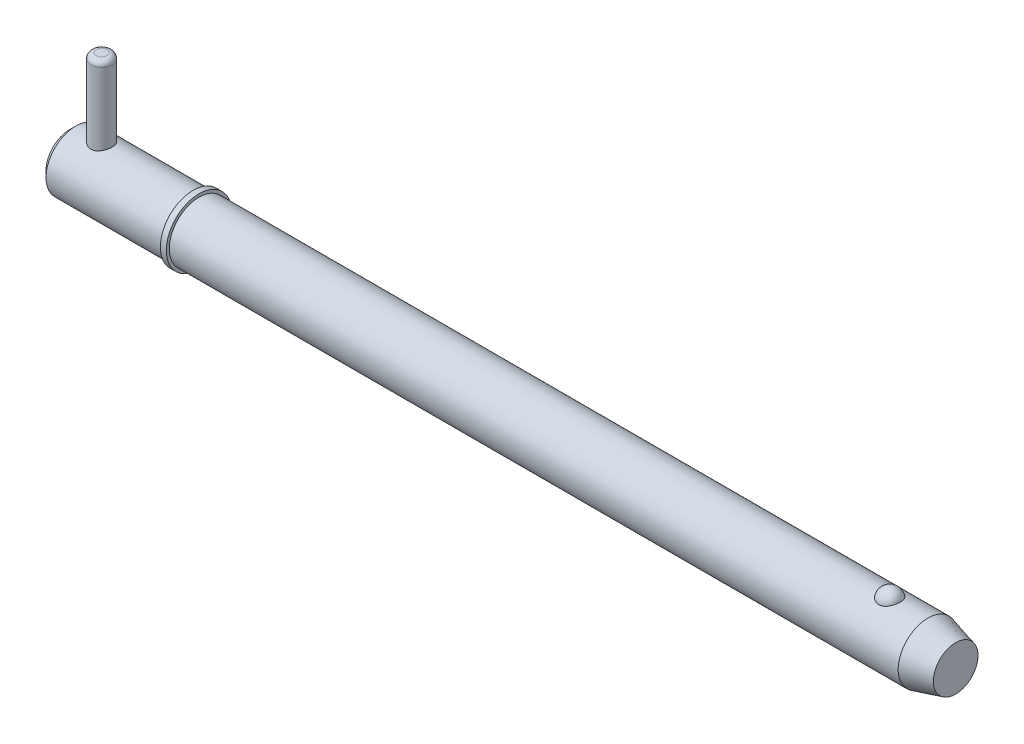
ISO-10303-21;
HEADER;
FILE_DESCRIPTION(('STEP AP214'),'2;1');
FILE_NAME('part.step','',(''),(''),'','','');
FILE_SCHEMA(('AUTOMOTIVE_DESIGN { 1 0 10303 214 1 1 1 1 }'));
ENDSEC;
DATA;
#1=APPLICATION_CONTEXT('core data for automotive mechanical design processes');
#2=APPLICATION_PROTOCOL_DEFINITION('international standard','automotive_design',2000,#1);
#3=PRODUCT_CONTEXT('',#1,'mechanical');
#4=PRODUCT('Part','Part','',(#3));
#5=PRODUCT_RELATED_PRODUCT_CATEGORY('part','',(#4));
#6=PRODUCT_DEFINITION_FORMATION('','',#4);
#7=PRODUCT_DEFINITION_CONTEXT('part definition',#1,'design');
#8=PRODUCT_DEFINITION('design','',#6,#7);
#9=PRODUCT_DEFINITION_SHAPE('','',#8);
#10=(LENGTH_UNIT() NAMED_UNIT(*) SI_UNIT(.MILLI.,.METRE.));
#11=(NAMED_UNIT(*) PLANE_ANGLE_UNIT() SI_UNIT($,.RADIAN.));
#12=(NAMED_UNIT(*) SI_UNIT($,.STERADIAN.) SOLID_ANGLE_UNIT());
#13=UNCERTAINTY_MEASURE_WITH_UNIT(LENGTH_MEASURE(1.E-05),#10,'distance_accuracy_value','');
#14=(GEOMETRIC_REPRESENTATION_CONTEXT(3) GLOBAL_UNCERTAINTY_ASSIGNED_CONTEXT((#13)) GLOBAL_UNIT_ASSIGNED_CONTEXT((#10,
#11,#12)) REPRESENTATION_CONTEXT('',''));
#15=CARTESIAN_POINT('',(0.,0.,0.));
#16=DIRECTION('',(0.,0.,1.));
#17=DIRECTION('',(1.,0.,0.));
#18=AXIS2_PLACEMENT_3D('',#15,#16,#17);
#19=CARTESIAN_POINT('',(5.94,19.845,0.));
#20=DIRECTION('',(0.,-1.,0.));
#21=DIRECTION('',(0.,0.,-1.));
#22=AXIS2_PLACEMENT_3D('',#19,#20,#21);
#23=CYLINDRICAL_SURFACE('',#22,1.98);
#24=CARTESIAN_POINT('',(5.94,-4.565,0.));
#25=DIRECTION('',(0.,1.,0.));
#26=DIRECTION('',(0.,0.,1.));
#27=AXIS2_PLACEMENT_3D('',#24,#25,#26);
#28=CIRCLE('',#27,1.98);
#29=CARTESIAN_POINT('',(5.94,-4.565,1.98));
#30=VERTEX_POINT('',#29);
#31=EDGE_CURVE('P0_E25',#30,#30,#28,.T.);
#32=ORIENTED_EDGE('',*,*,#31,.T.);
#33=EDGE_LOOP('',(#32));
#34=FACE_BOUND('',#33,.T.);
#35=CARTESIAN_POINT('',(5.94,18.855,0.));
#36=DIRECTION('',(0.,1.,0.));
#37=DIRECTION('',(0.,0.,1.));
#38=AXIS2_PLACEMENT_3D('',#35,#36,#37);
#39=CIRCLE('',#38,1.98);
#40=CARTESIAN_POINT('',(5.94,18.855,1.98));
#41=VERTEX_POINT('',#40);
#42=EDGE_CURVE('P0_E29',#41,#41,#39,.F.);
#43=ORIENTED_EDGE('',*,*,#42,.T.);
#44=EDGE_LOOP('',(#43));
#45=FACE_BOUND('',#44,.T.);
#46=ADVANCED_FACE('P0_F14',(#34,#45),#23,.T.);
#47=CARTESIAN_POINT('',(5.94,19.845,0.));
#48=DIRECTION('',(0.,1.,0.));
#49=DIRECTION('',(0.,0.,1.));
#50=AXIS2_PLACEMENT_3D('',#47,#48,#49);
#51=PLANE('',#50);
#52=CARTESIAN_POINT('',(5.94,19.845,0.));
#53=DIRECTION('',(0.,1.,0.));
#54=DIRECTION('',(0.,0.,1.));
#55=AXIS2_PLACEMENT_3D('',#52,#53,#54);
#56=CIRCLE('',#55,0.99);
#57=CARTESIAN_POINT('',(5.94,19.845,0.99));
#58=VERTEX_POINT('',#57);
#59=EDGE_CURVE('P0_E10',#58,#58,#56,.T.);
#60=ORIENTED_EDGE('',*,*,#59,.T.);
#61=EDGE_LOOP('',(#60));
#62=FACE_BOUND('',#61,.T.);
#63=ADVANCED_FACE('P0_F46',(#62),#51,.T.);
#64=CARTESIAN_POINT('',(5.94,-5.555,0.));
#65=DIRECTION('',(0.,1.,0.));
#66=DIRECTION('',(0.,0.,1.));
#67=AXIS2_PLACEMENT_3D('',#64,#65,#66);
#68=PLANE('',#67);
#69=CARTESIAN_POINT('',(5.94,-5.555,0.));
#70=DIRECTION('',(0.,1.,0.));
#71=DIRECTION('',(0.,0.,1.));
#72=AXIS2_PLACEMENT_3D('',#69,#70,#71);
#73=CIRCLE('',#72,0.99);
#74=CARTESIAN_POINT('',(5.94,-5.555,0.99));
#75=VERTEX_POINT('',#74);
#76=EDGE_CURVE('P0_E21',#75,#75,#73,.F.);
#77=ORIENTED_EDGE('',*,*,#76,.T.);
#78=EDGE_LOOP('',(#77));
#79=FACE_BOUND('',#78,.T.);
#80=ADVANCED_FACE('P0_F43',(#79),#68,.F.);
#81=CARTESIAN_POINT('',(5.94,-4.565,0.));
#82=DIRECTION('',(0.,1.,0.));
#83=DIRECTION('',(0.,0.,1.));
#84=AXIS2_PLACEMENT_3D('',#81,#82,#83);
#85=DEGENERATE_TOROIDAL_SURFACE('',#84,0.99,0.99,.T.);
#86=ORIENTED_EDGE('',*,*,#76,.F.);
#87=EDGE_LOOP('',(#86));
#88=FACE_BOUND('',#87,.T.);
#89=ORIENTED_EDGE('',*,*,#31,.F.);
#90=EDGE_LOOP('',(#89));
#91=FACE_BOUND('',#90,.T.);
#92=ADVANCED_FACE('P0_F38',(#88,#91),#85,.T.);
#93=CARTESIAN_POINT('',(5.94,18.855,0.));
#94=DIRECTION('',(0.,1.,0.));
#95=DIRECTION('',(0.,0.,1.));
#96=AXIS2_PLACEMENT_3D('',#93,#94,#95);
#97=DEGENERATE_TOROIDAL_SURFACE('',#96,0.99,0.99,.T.);
#98=ORIENTED_EDGE('',*,*,#42,.F.);
#99=EDGE_LOOP('',(#98));
#100=FACE_BOUND('',#99,.T.);
#101=ORIENTED_EDGE('',*,*,#59,.F.);
#102=EDGE_LOOP('',(#101));
#103=FACE_BOUND('',#102,.T.);
#104=ADVANCED_FACE('P0_F16',(#100,#103),#97,.T.);
#105=CLOSED_SHELL('',(#46,#63,#80,#92,#104));
#106=MANIFOLD_SOLID_BREP('P0_B1',#105);
#107=CARTESIAN_POINT('',(0.,0.,0.));
#108=DIRECTION('',(1.,0.,0.));
#109=DIRECTION('',(0.,0.,-1.));
#110=AXIS2_PLACEMENT_3D('',#107,#108,#109);
#111=CYLINDRICAL_SURFACE('',#110,5.555);
#112=CARTESIAN_POINT('',(160.217114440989,0.,0.));
#113=DIRECTION('',(1.,0.,0.));
#114=DIRECTION('',(0.,0.,-1.));
#115=AXIS2_PLACEMENT_3D('',#112,#113,#114);
#116=CIRCLE('',#115,5.555);
#117=CARTESIAN_POINT('',(160.217114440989,0.,-5.555));
#118=VERTEX_POINT('',#117);
#119=EDGE_CURVE('P1_E81',#118,#118,#116,.T.);
#120=ORIENTED_EDGE('',*,*,#119,.F.);
#121=EDGE_LOOP('',(#120));
#122=FACE_BOUND('',#121,.T.);
#123=CARTESIAN_POINT('',(24.13,0.,0.));
#124=DIRECTION('',(1.,0.,0.));
#125=DIRECTION('',(0.,0.,-1.));
#126=AXIS2_PLACEMENT_3D('',#123,#124,#125);
#127=CIRCLE('',#126,5.555);
#128=CARTESIAN_POINT('',(24.13,0.,-5.555));
#129=VERTEX_POINT('',#128);
#130=EDGE_CURVE('P1_E85',#129,#129,#127,.T.);
#131=ORIENTED_EDGE('',*,*,#130,.T.);
#132=EDGE_LOOP('',(#131));
#133=FACE_BOUND('',#132,.T.);
#134=CARTESIAN_POINT('',(153.098626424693,5.16741224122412,2.03859650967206));
#135=CARTESIAN_POINT('',(152.992949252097,5.16740893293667,2.03859990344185));
#136=CARTESIAN_POINT('',(152.88729894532,5.17079470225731,2.03008306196));
#137=CARTESIAN_POINT('',(152.679141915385,5.18392795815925,1.99630721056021));
#138=CARTESIAN_POINT('',(152.576634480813,5.19367399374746,1.97105201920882));
#139=CARTESIAN_POINT('',(152.377771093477,5.21839168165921,1.9046399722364));
#140=CARTESIAN_POINT('',(152.281406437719,5.23335573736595,1.8635062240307));
#141=CARTESIAN_POINT('',(152.097080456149,5.26688076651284,1.76652592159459));
#142=CARTESIAN_POINT('',(152.009120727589,5.28544242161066,1.71067657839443));
#143=CARTESIAN_POINT('',(151.841265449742,5.32479845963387,1.58399959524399));
#144=CARTESIAN_POINT('',(151.76166564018,5.34564089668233,1.51279545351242));
#145=CARTESIAN_POINT('',(151.61512901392,5.38697258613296,1.35828584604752));
#146=CARTESIAN_POINT('',(151.548194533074,5.40746177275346,1.27497815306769));
#147=CARTESIAN_POINT('',(151.42561039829,5.44694508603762,1.0944029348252));
#148=CARTESIAN_POINT('',(151.370598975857,5.46583143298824,0.996677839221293));
#149=CARTESIAN_POINT('',(151.276937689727,5.49908030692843,0.792961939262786));
#150=CARTESIAN_POINT('',(151.238289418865,5.513442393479,0.686970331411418));
#151=CARTESIAN_POINT('',(151.177680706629,5.53635851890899,0.468019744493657));
#152=CARTESIAN_POINT('',(151.155972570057,5.54482455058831,0.354981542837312));
#153=CARTESIAN_POINT('',(151.130636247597,5.55473324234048,0.12659586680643));
#154=CARTESIAN_POINT('',(151.127007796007,5.55617600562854,0.0112484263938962));
#155=CARTESIAN_POINT('',(151.137881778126,5.55189984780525,-0.218011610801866));
#156=CARTESIAN_POINT('',(151.152315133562,5.54620821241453,-0.331928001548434));
#157=CARTESIAN_POINT('',(151.198903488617,5.52828920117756,-0.555544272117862));
#158=CARTESIAN_POINT('',(151.231058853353,5.5160616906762,-0.665244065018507));
#159=CARTESIAN_POINT('',(151.312488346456,5.48630779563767,-0.877469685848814));
#160=CARTESIAN_POINT('',(151.361781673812,5.4687754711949,-0.979987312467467));
#161=CARTESIAN_POINT('',(151.476478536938,5.43024700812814,-1.17486975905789));
#162=CARTESIAN_POINT('',(151.541883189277,5.4092506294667,-1.26723387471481));
#163=CARTESIAN_POINT('',(151.687571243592,5.36600927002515,-1.4394013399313));
#164=CARTESIAN_POINT('',(151.767885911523,5.34376173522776,-1.51917763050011));
#165=CARTESIAN_POINT('',(151.941452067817,5.30057971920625,-1.66360338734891));
#166=CARTESIAN_POINT('',(152.034702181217,5.27964509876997,-1.72825445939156));
#167=CARTESIAN_POINT('',(152.229393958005,5.24205250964,-1.83909478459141));
#168=CARTESIAN_POINT('',(152.330590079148,5.22530519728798,-1.88568407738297));
#169=CARTESIAN_POINT('',(152.540155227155,5.1975091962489,-1.96100802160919));
#170=CARTESIAN_POINT('',(152.648521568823,5.1864583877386,-1.98974931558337));
#171=CARTESIAN_POINT('',(152.863498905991,5.17184410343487,-2.02742262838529));
#172=CARTESIAN_POINT('',(152.969925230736,5.1679328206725,-2.03727608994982));
#173=CARTESIAN_POINT('',(153.182992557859,5.16698995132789,-2.03966777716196));
#174=CARTESIAN_POINT('',(153.289633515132,5.16995704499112,-2.0322093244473));
#175=CARTESIAN_POINT('',(153.496773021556,5.18222383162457,-2.00071170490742));
#176=CARTESIAN_POINT('',(153.597359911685,5.19133213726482,-1.97717337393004));
#177=CARTESIAN_POINT('',(153.793014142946,5.21467637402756,-1.91475248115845));
#178=CARTESIAN_POINT('',(153.888081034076,5.22891272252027,-1.87586867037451));
#179=CARTESIAN_POINT('',(154.072371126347,5.26137066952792,-1.78282713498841));
#180=CARTESIAN_POINT('',(154.161419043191,5.27967329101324,-1.72835124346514));
#181=CARTESIAN_POINT('',(154.329288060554,5.3181741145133,-1.60597483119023));
#182=CARTESIAN_POINT('',(154.408106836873,5.33837274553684,-1.5380712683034));
#183=CARTESIAN_POINT('',(154.557515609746,5.37968287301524,-1.38688970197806));
#184=CARTESIAN_POINT('',(154.627505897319,5.40079011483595,-1.30301744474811));
#185=CARTESIAN_POINT('',(154.753012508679,5.44074401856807,-1.12458170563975));
#186=CARTESIAN_POINT('',(154.808526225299,5.45959027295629,-1.03001630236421));
#187=CARTESIAN_POINT('',(154.905550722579,5.49369849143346,-0.829439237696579));
#188=CARTESIAN_POINT('',(154.946548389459,5.50882422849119,-0.723155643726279));
#189=CARTESIAN_POINT('',(155.011125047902,5.53310911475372,-0.504772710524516));
#190=CARTESIAN_POINT('',(155.034703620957,5.54226812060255,-0.392673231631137));
#191=CARTESIAN_POINT('',(155.064013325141,5.55370358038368,-0.165459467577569));
#192=CARTESIAN_POINT('',(155.069688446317,5.55595843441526,-0.0503368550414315));
#193=CARTESIAN_POINT('',(155.062916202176,5.55329317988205,0.179288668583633));
#194=CARTESIAN_POINT('',(155.050469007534,5.54837313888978,0.293791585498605));
#195=CARTESIAN_POINT('',(155.007779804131,5.53189037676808,0.51852641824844));
#196=CARTESIAN_POINT('',(154.977598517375,5.5203503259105,0.62877154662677));
#197=CARTESIAN_POINT('',(154.900096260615,5.49182453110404,0.842318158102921));
#198=CARTESIAN_POINT('',(154.852774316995,5.47483847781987,0.945619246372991));
#199=CARTESIAN_POINT('',(154.741720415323,5.43710633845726,1.14281571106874));
#200=CARTESIAN_POINT('',(154.677921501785,5.41634501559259,1.23667048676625));
#201=CARTESIAN_POINT('',(154.535357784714,5.37334572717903,1.4118524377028));
#202=CARTESIAN_POINT('',(154.45659323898,5.35110778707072,1.49317982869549));
#203=CARTESIAN_POINT('',(154.286423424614,5.30779474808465,1.64049162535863));
#204=CARTESIAN_POINT('',(154.19510026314,5.28671324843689,1.70656877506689));
#205=CARTESIAN_POINT('',(154.001739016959,5.2480485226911,1.82201372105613));
#206=CARTESIAN_POINT('',(153.899700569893,5.23046541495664,1.87138095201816));
#207=CARTESIAN_POINT('',(153.683618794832,5.20042692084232,1.95335298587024));
#208=CARTESIAN_POINT('',(153.569260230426,5.18820192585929,1.98521734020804));
#209=CARTESIAN_POINT('',(153.336130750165,5.17169804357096,2.02783294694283));
#210=CARTESIAN_POINT('',(153.217361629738,5.16741595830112,2.03859269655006));
#211=CARTESIAN_POINT('',(153.098626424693,5.16741224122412,2.03859650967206));
#212=B_SPLINE_CURVE_WITH_KNOTS('',3,(#134,#135,#136,#137,#138,#139,#140,#141,#142,#143,#144,
#145,#146,#147,#148,#149,#150,#151,#152,#153,#154,#155,#156,#157,#158,#159,#160,#161,#162,#163,
#164,#165,#166,#167,#168,#169,#170,#171,#172,#173,#174,#175,#176,#177,#178,#179,#180,#181,#182,
#183,#184,#185,#186,#187,#188,#189,#190,#191,#192,#193,#194,#195,#196,#197,#198,#199,#200,#201,
#202,#203,#204,#205,#206,#207,#208,#209,#210,#211),.UNSPECIFIED.,.T.,.F.,(4,2,2,2,2,2,2,2,2,2,2,
2,2,2,2,2,2,2,2,2,2,2,2,2,2,2,2,2,2,2,2,2,2,2,2,2,2,2,4),(0.,0.316595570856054,
0.633118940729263,0.94918341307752,1.26530783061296,1.59030762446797,1.91536729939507,
2.25495824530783,2.59458224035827,2.93917283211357,3.28375835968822,3.62703002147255,
3.97030875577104,4.31397329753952,4.657661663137,5.00207904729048,5.34645984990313,
5.68270547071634,6.01882587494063,6.33808403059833,6.65728093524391,6.9669637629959,
7.27667180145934,7.59321535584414,7.90983070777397,8.24210387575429,8.57443684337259,
8.91755896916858,9.26068933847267,9.60489211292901,9.94909164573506,10.2921194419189,
10.6351667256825,10.9796305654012,11.3240884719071,11.6663928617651,12.0087088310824,
12.3645679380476,12.7202837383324),.UNSPECIFIED.);
#213=CARTESIAN_POINT('',(153.098626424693,5.16741224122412,2.03859650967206));
#214=VERTEX_POINT('',#213);
#215=EDGE_CURVE('P1_E35',#214,#214,#212,.T.);
#216=ORIENTED_EDGE('',*,*,#215,.T.);
#217=EDGE_LOOP('',(#216));
#218=FACE_BOUND('',#217,.T.);
#219=ADVANCED_FACE('P1_F13',(#122,#133,#218),#111,.T.);
#220=CARTESIAN_POINT('',(0.,0.,0.));
#221=DIRECTION('',(-1.,0.,0.));
#222=DIRECTION('',(0.,0.,1.));
#223=AXIS2_PLACEMENT_3D('',#220,#221,#222);
#224=PLANE('',#223);
#225=CARTESIAN_POINT('',(0.,0.,0.));
#226=DIRECTION('',(1.,0.,0.));
#227=DIRECTION('',(0.,0.,-1.));
#228=AXIS2_PLACEMENT_3D('',#225,#226,#227);
#229=CIRCLE('',#228,4.444);
#230=CARTESIAN_POINT('',(0.,0.,-4.444));
#231=VERTEX_POINT('',#230);
#232=EDGE_CURVE('P1_E9',#231,#231,#229,.T.);
#233=ORIENTED_EDGE('',*,*,#232,.F.);
#234=EDGE_LOOP('',(#233));
#235=FACE_BOUND('',#234,.T.);
#236=ADVANCED_FACE('P1_F15',(#235),#224,.T.);
#237=CARTESIAN_POINT('',(1.111,0.,0.));
#238=DIRECTION('',(1.,0.,0.));
#239=DIRECTION('',(0.,0.,-1.));
#240=AXIS2_PLACEMENT_3D('',#237,#238,#239);
#241=CONICAL_SURFACE('',#240,5.555,0.78539816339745);
#242=ORIENTED_EDGE('',*,*,#232,.T.);
#243=EDGE_LOOP('',(#242));
#244=FACE_BOUND('',#243,.T.);
#245=CARTESIAN_POINT('',(1.111,0.,0.));
#246=DIRECTION('',(1.,0.,0.));
#247=DIRECTION('',(0.,0.,-1.));
#248=AXIS2_PLACEMENT_3D('',#245,#246,#247);
#249=CIRCLE('',#248,5.555);
#250=CARTESIAN_POINT('',(1.111,0.,-5.555));
#251=VERTEX_POINT('',#250);
#252=EDGE_CURVE('P1_E26',#251,#251,#249,.T.);
#253=ORIENTED_EDGE('',*,*,#252,.F.);
#254=EDGE_LOOP('',(#253));
#255=FACE_BOUND('',#254,.T.);
#256=ADVANCED_FACE('P1_F77',(#244,#255),#241,.T.);
#257=CARTESIAN_POINT('',(0.,0.,0.));
#258=DIRECTION('',(1.,0.,0.));
#259=DIRECTION('',(0.,0.,-1.));
#260=AXIS2_PLACEMENT_3D('',#257,#258,#259);
#261=CYLINDRICAL_SURFACE('',#260,5.555);
#262=CARTESIAN_POINT('',(5.94,-5.19014691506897,1.98));
#263=CARTESIAN_POINT('',(5.83264687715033,-5.19014494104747,1.98000226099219));
#264=CARTESIAN_POINT('',(5.7253094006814,-5.19351395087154,1.97123988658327));
#265=CARTESIAN_POINT('',(5.51384517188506,-5.20654291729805,1.93656219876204));
#266=CARTESIAN_POINT('',(5.40971858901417,-5.21620320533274,1.91064598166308));
#267=CARTESIAN_POINT('',(5.20778082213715,-5.24058443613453,1.84271148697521));
#268=CARTESIAN_POINT('',(5.10995634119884,-5.25529427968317,1.80072850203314));
#269=CARTESIAN_POINT('',(4.92270352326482,-5.28810012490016,1.70197537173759));
#270=CARTESIAN_POINT('',(4.83327743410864,-5.3061970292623,1.64520128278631));
#271=CARTESIAN_POINT('',(4.66135184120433,-5.34464714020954,1.51575187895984));
#272=CARTESIAN_POINT('',(4.57928277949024,-5.36506222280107,1.44252311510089));
#273=CARTESIAN_POINT('',(4.42829115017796,-5.40532920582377,1.28342047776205));
#274=CARTESIAN_POINT('',(4.35937105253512,-5.42518099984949,1.19754423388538));
#275=CARTESIAN_POINT('',(4.23461605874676,-5.46281133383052,1.01237205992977));
#276=CARTESIAN_POINT('',(4.17924129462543,-5.48050875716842,0.912748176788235));
#277=CARTESIAN_POINT('',(4.0862117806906,-5.51109938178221,0.70485824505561));
#278=CARTESIAN_POINT('',(4.0485515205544,-5.52399407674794,0.596594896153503));
#279=CARTESIAN_POINT('',(3.99350662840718,-5.54308759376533,0.379019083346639));
#280=CARTESIAN_POINT('',(3.97538263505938,-5.54952987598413,0.269915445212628));
#281=CARTESIAN_POINT('',(3.95756405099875,-5.55586205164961,0.0500378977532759));
#282=CARTESIAN_POINT('',(3.95786404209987,-5.55575387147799,-0.060735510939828));
#283=CARTESIAN_POINT('',(3.97643665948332,-5.54915684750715,-0.275539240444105));
#284=CARTESIAN_POINT('',(3.99390415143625,-5.54295384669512,-0.379649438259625));
#285=CARTESIAN_POINT('',(4.0449721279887,-5.52523170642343,-0.583350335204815));
#286=CARTESIAN_POINT('',(4.07857373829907,-5.51371219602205,-0.682940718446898));
#287=CARTESIAN_POINT('',(4.16137312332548,-5.4863099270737,-0.876423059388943));
#288=CARTESIAN_POINT('',(4.2107826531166,-5.47036834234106,-0.970215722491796));
#289=CARTESIAN_POINT('',(4.32361427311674,-5.43575653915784,-1.1484017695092));
#290=CARTESIAN_POINT('',(4.38704062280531,-5.41708549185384,-1.23279228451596));
#291=CARTESIAN_POINT('',(4.53006791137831,-5.37778429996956,-1.39454579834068));
#292=CARTESIAN_POINT('',(4.61035105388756,-5.35710277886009,-1.4712940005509));
#293=CARTESIAN_POINT('',(4.78279835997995,-5.31692766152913,-1.6104545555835));
#294=CARTESIAN_POINT('',(4.874964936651,-5.29743430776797,-1.67286398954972));
#295=CARTESIAN_POINT('',(5.07076688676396,-5.26153775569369,-1.78259698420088));
#296=CARTESIAN_POINT('',(5.17458163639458,-5.24519780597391,-1.8296227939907));
#297=CARTESIAN_POINT('',(5.38938990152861,-5.21818744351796,-1.90530278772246));
#298=CARTESIAN_POINT('',(5.50037985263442,-5.20751423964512,-1.93396601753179));
#299=CARTESIAN_POINT('',(5.72036376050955,-5.19369176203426,-1.97077654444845));
#300=CARTESIAN_POINT('',(5.82917370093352,-5.19018851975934,-1.97989015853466));
#301=CARTESIAN_POINT('',(6.04680100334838,-5.19010609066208,-1.98010779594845));
#302=CARTESIAN_POINT('',(6.15561835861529,-5.19352540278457,-1.97121572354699));
#303=CARTESIAN_POINT('',(6.36548036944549,-5.20654623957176,-1.93654727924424));
#304=CARTESIAN_POINT('',(6.46666051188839,-5.21588705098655,-1.91148218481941));
#305=CARTESIAN_POINT('',(6.66334537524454,-5.23939939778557,-1.84605494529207));
#306=CARTESIAN_POINT('',(6.75884899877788,-5.25357186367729,-1.8056898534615));
#307=CARTESIAN_POINT('',(6.94517989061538,-5.28576258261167,-1.70921153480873));
#308=CARTESIAN_POINT('',(7.03572661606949,-5.30389804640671,-1.65259670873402));
#309=CARTESIAN_POINT('',(7.20638087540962,-5.34176077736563,-1.52577523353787));
#310=CARTESIAN_POINT('',(7.28648490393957,-5.36148857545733,-1.45556404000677));
#311=CARTESIAN_POINT('',(7.43864697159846,-5.40165494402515,-1.2988614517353));
#312=CARTESIAN_POINT('',(7.50999887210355,-5.42207106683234,-1.21167640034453));
#313=CARTESIAN_POINT('',(7.63712639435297,-5.46023601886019,-1.026066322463));
#314=CARTESIAN_POINT('',(7.69290228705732,-5.47798489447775,-0.927641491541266));
#315=CARTESIAN_POINT('',(7.78684673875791,-5.50876590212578,-0.722633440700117));
#316=CARTESIAN_POINT('',(7.82510508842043,-5.52182201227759,-0.616095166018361));
#317=CARTESIAN_POINT('',(7.88297051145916,-5.54184206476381,-0.397530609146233));
#318=CARTESIAN_POINT('',(7.90258540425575,-5.5488085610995,-0.285506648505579));
#319=CARTESIAN_POINT('',(7.9218262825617,-5.55564472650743,-0.065566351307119));
#320=CARTESIAN_POINT('',(7.92245987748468,-5.55587212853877,0.0422515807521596));
#321=CARTESIAN_POINT('',(7.90626329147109,-5.55011340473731,0.256387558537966));
#322=CARTESIAN_POINT('',(7.88943488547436,-5.54412791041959,0.362705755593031));
#323=CARTESIAN_POINT('',(7.83948457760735,-5.52676548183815,0.568649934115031));
#324=CARTESIAN_POINT('',(7.8067003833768,-5.51550046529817,0.668367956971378));
#325=CARTESIAN_POINT('',(7.72609369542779,-5.48874437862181,0.860911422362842));
#326=CARTESIAN_POINT('',(7.67826838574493,-5.47325251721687,0.953735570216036));
#327=CARTESIAN_POINT('',(7.56675024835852,-5.43884382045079,1.13391068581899));
#328=CARTESIAN_POINT('',(7.50249968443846,-5.41981485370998,1.22089468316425));
#329=CARTESIAN_POINT('',(7.36086495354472,-5.38069275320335,1.38316665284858));
#330=CARTESIAN_POINT('',(7.28347630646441,-5.36059925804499,1.45845061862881));
#331=CARTESIAN_POINT('',(7.11347587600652,-5.32048380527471,1.59876646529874));
#332=CARTESIAN_POINT('',(7.02032386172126,-5.30050854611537,1.66315951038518));
#333=CARTESIAN_POINT('',(6.82388804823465,-5.26398994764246,1.77536801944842));
#334=CARTESIAN_POINT('',(6.7206049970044,-5.24744635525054,1.82318470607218));
#335=CARTESIAN_POINT('',(6.50639706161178,-5.21987969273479,1.90068230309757));
#336=CARTESIAN_POINT('',(6.3954529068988,-5.20887116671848,1.93031547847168));
#337=CARTESIAN_POINT('',(6.16966522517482,-5.19400760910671,1.96996824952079));
#338=CARTESIAN_POINT('',(6.05482366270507,-5.19014902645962,1.97999758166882));
#339=CARTESIAN_POINT('',(5.94,-5.19014691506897,1.98));
#340=B_SPLINE_CURVE_WITH_KNOTS('',3,(#262,#263,#264,#265,#266,#267,#268,#269,#270,#271,#272,
#273,#274,#275,#276,#277,#278,#279,#280,#281,#282,#283,#284,#285,#286,#287,#288,#289,#290,#291,
#292,#293,#294,#295,#296,#297,#298,#299,#300,#301,#302,#303,#304,#305,#306,#307,#308,#309,#310,
#311,#312,#313,#314,#315,#316,#317,#318,#319,#320,#321,#322,#323,#324,#325,#326,#327,#328,#329,
#330,#331,#332,#333,#334,#335,#336,#337,#338,#339),.UNSPECIFIED.,.T.,.F.,(4,2,2,2,2,2,2,2,2,2,2,
2,2,2,2,2,2,2,2,2,2,2,2,2,2,2,2,2,2,2,2,2,2,2,2,2,2,2,4),(0.,0.321632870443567,
0.643282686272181,0.964229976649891,1.28526292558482,1.61937087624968,1.9535415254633,
2.29784481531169,2.64204093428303,2.97269632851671,3.30325448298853,3.61901541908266,
3.93479838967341,4.25500220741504,4.57530346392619,4.91268648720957,5.25013812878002,
5.59378026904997,5.93725299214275,6.26331481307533,6.58930593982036,6.90185604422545,
7.21446637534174,7.53801472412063,7.86167140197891,8.20353561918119,8.54539388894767,
8.88547970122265,9.22542281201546,9.54728637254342,9.86911722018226,10.1844146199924,
10.4997710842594,10.827730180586,11.1558013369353,11.499115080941,11.8424034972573,
12.1865892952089,12.5306041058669),.UNSPECIFIED.);
#341=CARTESIAN_POINT('',(5.94,-5.19014691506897,1.98));
#342=VERTEX_POINT('',#341);
#343=EDGE_CURVE('P1_E17',#342,#342,#340,.T.);
#344=ORIENTED_EDGE('',*,*,#343,.F.);
#345=EDGE_LOOP('',(#344));
#346=FACE_BOUND('',#345,.T.);
#347=CARTESIAN_POINT('',(5.94,5.19014691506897,1.98));
#348=CARTESIAN_POINT('',(6.04735312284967,5.19014494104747,1.98000226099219));
#349=CARTESIAN_POINT('',(6.1546905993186,5.19351395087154,1.97123988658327));
#350=CARTESIAN_POINT('',(6.36615482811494,5.20654291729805,1.93656219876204));
#351=CARTESIAN_POINT('',(6.47028141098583,5.21620320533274,1.91064598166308));
#352=CARTESIAN_POINT('',(6.67221917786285,5.24058443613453,1.84271148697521));
#353=CARTESIAN_POINT('',(6.77004365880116,5.25529427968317,1.80072850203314));
#354=CARTESIAN_POINT('',(6.95729647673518,5.28810012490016,1.70197537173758));
#355=CARTESIAN_POINT('',(7.04672256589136,5.3061970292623,1.64520128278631));
#356=CARTESIAN_POINT('',(7.21864815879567,5.34464714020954,1.51575187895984));
#357=CARTESIAN_POINT('',(7.30071722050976,5.36506222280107,1.44252311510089));
#358=CARTESIAN_POINT('',(7.45170884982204,5.40532920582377,1.28342047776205));
#359=CARTESIAN_POINT('',(7.52062894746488,5.42518099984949,1.19754423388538));
#360=CARTESIAN_POINT('',(7.64538394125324,5.46281133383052,1.01237205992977));
#361=CARTESIAN_POINT('',(7.70075870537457,5.48050875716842,0.912748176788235));
#362=CARTESIAN_POINT('',(7.7937882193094,5.51109938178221,0.704858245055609));
#363=CARTESIAN_POINT('',(7.8314484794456,5.52399407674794,0.596594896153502));
#364=CARTESIAN_POINT('',(7.88649337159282,5.54308759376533,0.379019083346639));
#365=CARTESIAN_POINT('',(7.90461736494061,5.54952987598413,0.269915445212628));
#366=CARTESIAN_POINT('',(7.92243594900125,5.55586205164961,0.0500378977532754));
#367=CARTESIAN_POINT('',(7.92213595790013,5.55575387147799,-0.0607355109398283));
#368=CARTESIAN_POINT('',(7.90356334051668,5.54915684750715,-0.275539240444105));
#369=CARTESIAN_POINT('',(7.88609584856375,5.54295384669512,-0.379649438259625));
#370=CARTESIAN_POINT('',(7.8350278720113,5.52523170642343,-0.583350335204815));
#371=CARTESIAN_POINT('',(7.80142626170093,5.51371219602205,-0.682940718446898));
#372=CARTESIAN_POINT('',(7.71862687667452,5.4863099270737,-0.876423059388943));
#373=CARTESIAN_POINT('',(7.6692173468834,5.47036834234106,-0.970215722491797));
#374=CARTESIAN_POINT('',(7.55638572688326,5.43575653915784,-1.1484017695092));
#375=CARTESIAN_POINT('',(7.49295937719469,5.41708549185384,-1.23279228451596));
#376=CARTESIAN_POINT('',(7.34993208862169,5.37778429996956,-1.39454579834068));
#377=CARTESIAN_POINT('',(7.26964894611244,5.35710277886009,-1.4712940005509));
#378=CARTESIAN_POINT('',(7.09720164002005,5.31692766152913,-1.6104545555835));
#379=CARTESIAN_POINT('',(7.00503506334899,5.29743430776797,-1.67286398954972));
#380=CARTESIAN_POINT('',(6.80923311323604,5.26153775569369,-1.78259698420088));
#381=CARTESIAN_POINT('',(6.70541836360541,5.24519780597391,-1.8296227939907));
#382=CARTESIAN_POINT('',(6.49061009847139,5.21818744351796,-1.90530278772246));
#383=CARTESIAN_POINT('',(6.37962014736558,5.20751423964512,-1.93396601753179));
#384=CARTESIAN_POINT('',(6.15963623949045,5.19369176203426,-1.97077654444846));
#385=CARTESIAN_POINT('',(6.05082629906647,5.19018851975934,-1.97989015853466));
#386=CARTESIAN_POINT('',(5.83319899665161,5.19010609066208,-1.98010779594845));
#387=CARTESIAN_POINT('',(5.7243816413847,5.19352540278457,-1.97121572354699));
#388=CARTESIAN_POINT('',(5.5145196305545,5.20654623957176,-1.93654727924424));
#389=CARTESIAN_POINT('',(5.4133394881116,5.21588705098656,-1.91148218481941));
#390=CARTESIAN_POINT('',(5.21665462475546,5.23939939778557,-1.84605494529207));
#391=CARTESIAN_POINT('',(5.12115100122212,5.25357186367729,-1.8056898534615));
#392=CARTESIAN_POINT('',(4.93482010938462,5.28576258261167,-1.70921153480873));
#393=CARTESIAN_POINT('',(4.84427338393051,5.30389804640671,-1.65259670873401));
#394=CARTESIAN_POINT('',(4.67361912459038,5.34176077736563,-1.52577523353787));
#395=CARTESIAN_POINT('',(4.59351509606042,5.36148857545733,-1.45556404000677));
#396=CARTESIAN_POINT('',(4.44135302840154,5.40165494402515,-1.2988614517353));
#397=CARTESIAN_POINT('',(4.37000112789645,5.42207106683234,-1.21167640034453));
#398=CARTESIAN_POINT('',(4.24287360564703,5.46023601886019,-1.026066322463));
#399=CARTESIAN_POINT('',(4.18709771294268,5.47798489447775,-0.927641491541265));
#400=CARTESIAN_POINT('',(4.09315326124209,5.50876590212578,-0.722633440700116));
#401=CARTESIAN_POINT('',(4.05489491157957,5.52182201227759,-0.61609516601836));
#402=CARTESIAN_POINT('',(3.99702948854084,5.54184206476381,-0.397530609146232));
#403=CARTESIAN_POINT('',(3.97741459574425,5.5488085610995,-0.285506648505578));
#404=CARTESIAN_POINT('',(3.9581737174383,5.55564472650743,-0.0655663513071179));
#405=CARTESIAN_POINT('',(3.95754012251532,5.55587212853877,0.0422515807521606));
#406=CARTESIAN_POINT('',(3.97373670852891,5.55011340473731,0.256387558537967));
#407=CARTESIAN_POINT('',(3.99056511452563,5.54412791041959,0.362705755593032));
#408=CARTESIAN_POINT('',(4.04051542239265,5.52676548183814,0.568649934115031));
#409=CARTESIAN_POINT('',(4.07329961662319,5.51550046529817,0.668367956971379));
#410=CARTESIAN_POINT('',(4.15390630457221,5.48874437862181,0.860911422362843));
#411=CARTESIAN_POINT('',(4.20173161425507,5.47325251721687,0.953735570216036));
#412=CARTESIAN_POINT('',(4.31324975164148,5.43884382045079,1.13391068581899));
#413=CARTESIAN_POINT('',(4.37750031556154,5.41981485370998,1.22089468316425));
#414=CARTESIAN_POINT('',(4.51913504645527,5.38069275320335,1.38316665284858));
#415=CARTESIAN_POINT('',(4.59652369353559,5.36059925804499,1.45845061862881));
#416=CARTESIAN_POINT('',(4.76652412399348,5.32048380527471,1.59876646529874));
#417=CARTESIAN_POINT('',(4.85967613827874,5.30050854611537,1.66315951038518));
#418=CARTESIAN_POINT('',(5.05611195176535,5.26398994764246,1.77536801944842));
#419=CARTESIAN_POINT('',(5.1593950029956,5.24744635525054,1.82318470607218));
#420=CARTESIAN_POINT('',(5.37360293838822,5.21987969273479,1.90068230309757));
#421=CARTESIAN_POINT('',(5.4845470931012,5.20887116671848,1.93031547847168));
#422=CARTESIAN_POINT('',(5.71033477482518,5.19400760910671,1.96996824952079));
#423=CARTESIAN_POINT('',(5.82517633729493,5.19014902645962,1.97999758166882));
#424=CARTESIAN_POINT('',(5.94,5.19014691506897,1.98));
#425=B_SPLINE_CURVE_WITH_KNOTS('',3,(#347,#348,#349,#350,#351,#352,#353,#354,#355,#356,#357,
#358,#359,#360,#361,#362,#363,#364,#365,#366,#367,#368,#369,#370,#371,#372,#373,#374,#375,#376,
#377,#378,#379,#380,#381,#382,#383,#384,#385,#386,#387,#388,#389,#390,#391,#392,#393,#394,#395,
#396,#397,#398,#399,#400,#401,#402,#403,#404,#405,#406,#407,#408,#409,#410,#411,#412,#413,#414,
#415,#416,#417,#418,#419,#420,#421,#422,#423,#424),.UNSPECIFIED.,.T.,.F.,(4,2,2,2,2,2,2,2,2,2,2,
2,2,2,2,2,2,2,2,2,2,2,2,2,2,2,2,2,2,2,2,2,2,2,2,2,2,2,4),(0.,0.321632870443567,
0.643282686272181,0.964229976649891,1.28526292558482,1.61937087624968,1.9535415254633,
2.29784481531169,2.64204093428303,2.97269632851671,3.30325448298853,3.61901541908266,
3.93479838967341,4.25500220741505,4.57530346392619,4.91268648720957,5.25013812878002,
5.59378026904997,5.93725299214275,6.26331481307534,6.58930593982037,6.90185604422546,
7.21446637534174,7.53801472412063,7.86167140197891,8.20353561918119,8.54539388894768,
8.88547970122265,9.22542281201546,9.54728637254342,9.86911722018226,10.1844146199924,
10.4997710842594,10.827730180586,11.1558013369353,11.499115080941,11.8424034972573,
12.1865892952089,12.5306041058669),.UNSPECIFIED.);
#426=CARTESIAN_POINT('',(5.94,5.19014691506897,1.98));
#427=VERTEX_POINT('',#426);
#428=EDGE_CURVE('P1_E43',#427,#427,#425,.T.);
#429=ORIENTED_EDGE('',*,*,#428,.F.);
#430=EDGE_LOOP('',(#429));
#431=FACE_BOUND('',#430,.T.);
#432=ORIENTED_EDGE('',*,*,#252,.T.);
#433=EDGE_LOOP('',(#432));
#434=FACE_BOUND('',#433,.T.);
#435=CARTESIAN_POINT('',(23.019,0.,0.));
#436=DIRECTION('',(1.,0.,0.));
#437=DIRECTION('',(0.,0.,-1.));
#438=AXIS2_PLACEMENT_3D('',#435,#436,#437);
#439=CIRCLE('',#438,5.555);
#440=CARTESIAN_POINT('',(23.019,0.,-5.555));
#441=VERTEX_POINT('',#440);
#442=EDGE_CURVE('P1_E31',#441,#441,#439,.T.);
#443=ORIENTED_EDGE('',*,*,#442,.F.);
#444=EDGE_LOOP('',(#443));
#445=FACE_BOUND('',#444,.T.);
#446=ADVANCED_FACE('P1_F103',(#346,#431,#434,#445),#261,.T.);
#447=CARTESIAN_POINT('',(23.019,5.555,0.));
#448=DIRECTION('',(-1.,0.,0.));
#449=DIRECTION('',(0.,0.,1.));
#450=AXIS2_PLACEMENT_3D('',#447,#448,#449);
#451=PLANE('',#450);
#452=ORIENTED_EDGE('',*,*,#442,.T.);
#453=EDGE_LOOP('',(#452));
#454=FACE_BOUND('',#453,.T.);
#455=CARTESIAN_POINT('',(23.019,0.,0.));
#456=DIRECTION('',(1.,0.,0.));
#457=DIRECTION('',(0.,0.,-1.));
#458=AXIS2_PLACEMENT_3D('',#455,#456,#457);
#459=CIRCLE('',#458,6.1105);
#460=CARTESIAN_POINT('',(23.019,0.,-6.1105));
#461=VERTEX_POINT('',#460);
#462=EDGE_CURVE('P1_E91',#461,#461,#459,.T.);
#463=ORIENTED_EDGE('',*,*,#462,.F.);
#464=EDGE_LOOP('',(#463));
#465=FACE_BOUND('',#464,.T.);
#466=ADVANCED_FACE('P1_F100',(#454,#465),#451,.T.);
#467=CARTESIAN_POINT('',(0.,0.,0.));
#468=DIRECTION('',(1.,0.,0.));
#469=DIRECTION('',(0.,0.,-1.));
#470=AXIS2_PLACEMENT_3D('',#467,#468,#469);
#471=CYLINDRICAL_SURFACE('',#470,6.1105);
#472=ORIENTED_EDGE('',*,*,#462,.T.);
#473=EDGE_LOOP('',(#472));
#474=FACE_BOUND('',#473,.T.);
#475=CARTESIAN_POINT('',(24.13,0.,0.));
#476=DIRECTION('',(1.,0.,0.));
#477=DIRECTION('',(0.,0.,-1.));
#478=AXIS2_PLACEMENT_3D('',#475,#476,#477);
#479=CIRCLE('',#478,6.1105);
#480=CARTESIAN_POINT('',(24.13,0.,-6.1105));
#481=VERTEX_POINT('',#480);
#482=EDGE_CURVE('P1_E88',#481,#481,#479,.T.);
#483=ORIENTED_EDGE('',*,*,#482,.F.);
#484=EDGE_LOOP('',(#483));
#485=FACE_BOUND('',#484,.T.);
#486=ADVANCED_FACE('P1_F68',(#474,#485),#471,.T.);
#487=CARTESIAN_POINT('',(24.13,6.1105,0.));
#488=DIRECTION('',(1.,0.,0.));
#489=DIRECTION('',(0.,0.,-1.));
#490=AXIS2_PLACEMENT_3D('',#487,#488,#489);
#491=PLANE('',#490);
#492=ORIENTED_EDGE('',*,*,#482,.T.);
#493=EDGE_LOOP('',(#492));
#494=FACE_BOUND('',#493,.T.);
#495=ORIENTED_EDGE('',*,*,#130,.F.);
#496=EDGE_LOOP('',(#495));
#497=FACE_BOUND('',#496,.T.);
#498=ADVANCED_FACE('P1_F62',(#494,#497),#491,.T.);
#499=CARTESIAN_POINT('',(165.4,0.,0.));
#500=DIRECTION('',(-1.,0.,0.));
#501=DIRECTION('',(0.,0.,1.));
#502=AXIS2_PLACEMENT_3D('',#499,#500,#501);
#503=CONICAL_SURFACE('',#502,4.16625000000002,0.261799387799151);
#504=ORIENTED_EDGE('',*,*,#119,.T.);
#505=EDGE_LOOP('',(#504));
#506=FACE_BOUND('',#505,.T.);
#507=CARTESIAN_POINT('',(165.4,0.,0.));
#508=DIRECTION('',(1.,0.,0.));
#509=DIRECTION('',(0.,0.,-1.));
#510=AXIS2_PLACEMENT_3D('',#507,#508,#509);
#511=CIRCLE('',#510,4.16625000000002);
#512=CARTESIAN_POINT('',(165.4,0.,-4.16625000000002));
#513=VERTEX_POINT('',#512);
#514=EDGE_CURVE('P1_E42',#513,#513,#511,.T.);
#515=ORIENTED_EDGE('',*,*,#514,.F.);
#516=EDGE_LOOP('',(#515));
#517=FACE_BOUND('',#516,.T.);
#518=ADVANCED_FACE('P1_F59',(#506,#517),#503,.T.);
#519=CARTESIAN_POINT('',(165.4,4.16625000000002,0.));
#520=DIRECTION('',(1.,0.,0.));
#521=DIRECTION('',(0.,0.,-1.));
#522=AXIS2_PLACEMENT_3D('',#519,#520,#521);
#523=PLANE('',#522);
#524=ORIENTED_EDGE('',*,*,#514,.T.);
#525=EDGE_LOOP('',(#524));
#526=FACE_BOUND('',#525,.T.);
#527=ADVANCED_FACE('P1_F55',(#526),#523,.T.);
#528=CARTESIAN_POINT('',(153.098626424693,4.9995,0.));
#529=DIRECTION('',(-1.,0.,0.));
#530=DIRECTION('',(0.,1.,0.));
#531=AXIS2_PLACEMENT_3D('',#528,#529,#530);
#532=SPHERICAL_SURFACE('',#531,2.04550000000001);
#533=ORIENTED_EDGE('',*,*,#215,.F.);
#534=EDGE_LOOP('',(#533));
#535=FACE_BOUND('',#534,.T.);
#536=ADVANCED_FACE('P1_F50',(#535),#532,.T.);
#537=CARTESIAN_POINT('',(5.94,-6.1105,0.));
#538=DIRECTION('',(0.,1.,0.));
#539=DIRECTION('',(0.,0.,1.));
#540=AXIS2_PLACEMENT_3D('',#537,#538,#539);
#541=CYLINDRICAL_SURFACE('',#540,1.98);
#542=ORIENTED_EDGE('',*,*,#343,.T.);
#543=EDGE_LOOP('',(#542));
#544=FACE_BOUND('',#543,.T.);
#545=ORIENTED_EDGE('',*,*,#428,.T.);
#546=EDGE_LOOP('',(#545));
#547=FACE_BOUND('',#546,.T.);
#548=ADVANCED_FACE('P1_F54',(#544,#547),#541,.F.);
#549=CLOSED_SHELL('',(#219,#236,#256,#446,#466,#486,#498,#518,#527,#536,#548));
#550=MANIFOLD_SOLID_BREP('P1_B1',#549);
#551=ADVANCED_BREP_SHAPE_REPRESENTATION('',(#18,#106,#550),#14);
#552=SHAPE_DEFINITION_REPRESENTATION(#9,#551);
ENDSEC;
END-ISO-10303-21;
